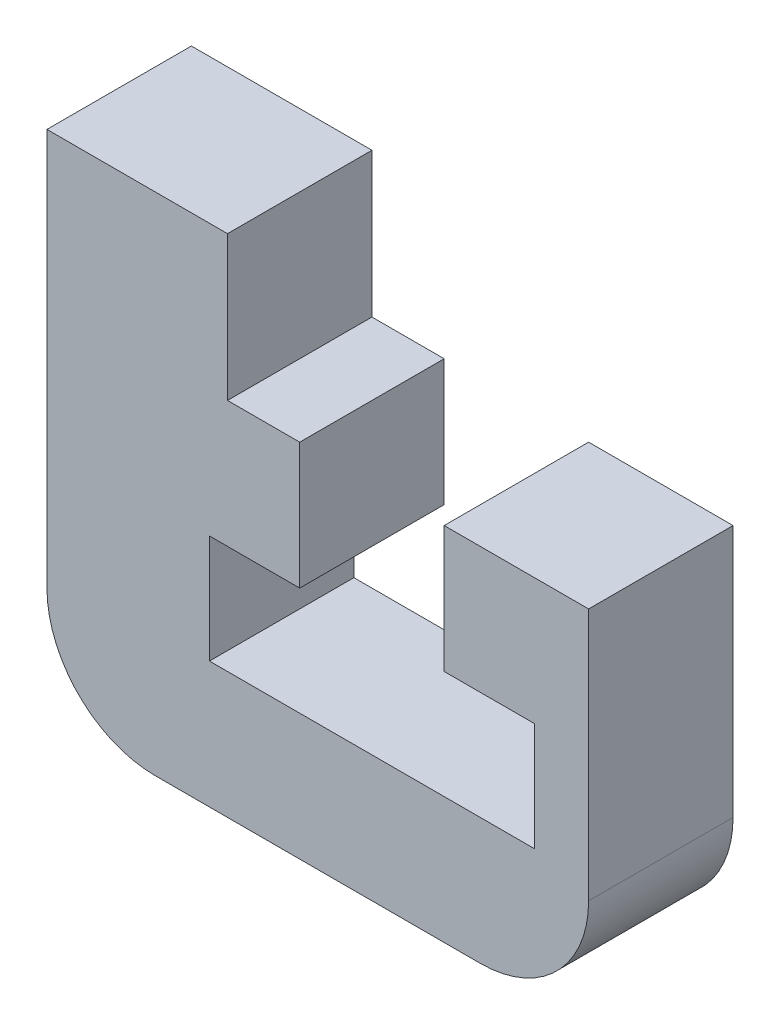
ISO-10303-21;
HEADER;
FILE_DESCRIPTION(('STEP AP214'),'2;1');
FILE_NAME('part.step','',(''),(''),'','','');
FILE_SCHEMA(('AUTOMOTIVE_DESIGN { 1 0 10303 214 1 1 1 1 }'));
ENDSEC;
DATA;
#1=APPLICATION_CONTEXT('core data for automotive mechanical design processes');
#2=APPLICATION_PROTOCOL_DEFINITION('international standard','automotive_design',2000,#1);
#3=PRODUCT_CONTEXT('',#1,'mechanical');
#4=PRODUCT('Part','Part','',(#3));
#5=PRODUCT_RELATED_PRODUCT_CATEGORY('part','',(#4));
#6=PRODUCT_DEFINITION_FORMATION('','',#4);
#7=PRODUCT_DEFINITION_CONTEXT('part definition',#1,'design');
#8=PRODUCT_DEFINITION('design','',#6,#7);
#9=PRODUCT_DEFINITION_SHAPE('','',#8);
#10=(LENGTH_UNIT() NAMED_UNIT(*) SI_UNIT(.MILLI.,.METRE.));
#11=(NAMED_UNIT(*) PLANE_ANGLE_UNIT() SI_UNIT($,.RADIAN.));
#12=(NAMED_UNIT(*) SI_UNIT($,.STERADIAN.) SOLID_ANGLE_UNIT());
#13=UNCERTAINTY_MEASURE_WITH_UNIT(LENGTH_MEASURE(1.E-05),#10,'distance_accuracy_value','');
#14=(GEOMETRIC_REPRESENTATION_CONTEXT(3) GLOBAL_UNCERTAINTY_ASSIGNED_CONTEXT((#13)) GLOBAL_UNIT_ASSIGNED_CONTEXT((#10,
#11,#12)) REPRESENTATION_CONTEXT('',''));
#15=CARTESIAN_POINT('',(0.,0.,0.));
#16=DIRECTION('',(0.,0.,1.));
#17=DIRECTION('',(1.,0.,0.));
#18=AXIS2_PLACEMENT_3D('',#15,#16,#17);
#19=CARTESIAN_POINT('',(-2.,12.0010272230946,4.));
#20=DIRECTION('',(0.,0.,-1.));
#21=DIRECTION('',(-1.,0.,0.));
#22=AXIS2_PLACEMENT_3D('',#19,#20,#21);
#23=CYLINDRICAL_SURFACE('',#22,3.);
#24=CARTESIAN_POINT('',(-2.,12.0010272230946,0.));
#25=DIRECTION('',(0.,0.,1.));
#26=DIRECTION('',(1.,0.,0.));
#27=AXIS2_PLACEMENT_3D('',#24,#25,#26);
#28=CIRCLE('',#27,3.);
#29=CARTESIAN_POINT('',(-5.,12.0010272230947,0.));
#30=VERTEX_POINT('',#29);
#31=CARTESIAN_POINT('',(-1.99999999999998,9.00102722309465,0.));
#32=VERTEX_POINT('',#31);
#33=EDGE_CURVE('E179',#30,#32,#28,.T.);
#34=ORIENTED_EDGE('',*,*,#33,.T.);
#35=DIRECTION('',(0.,0.,-1.));
#36=VECTOR('',#35,1.);
#37=CARTESIAN_POINT('',(-1.99999999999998,9.00102722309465,4.));
#38=LINE('',#37,#36);
#39=CARTESIAN_POINT('',(-1.99999999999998,9.00102722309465,4.));
#40=VERTEX_POINT('',#39);
#41=EDGE_CURVE('E11',#40,#32,#38,.T.);
#42=ORIENTED_EDGE('',*,*,#41,.F.);
#43=CARTESIAN_POINT('',(-2.,12.0010272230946,4.));
#44=DIRECTION('',(0.,0.,1.));
#45=DIRECTION('',(1.,0.,0.));
#46=AXIS2_PLACEMENT_3D('',#43,#44,#45);
#47=CIRCLE('',#46,3.);
#48=CARTESIAN_POINT('',(-5.,12.0010272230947,4.));
#49=VERTEX_POINT('',#48);
#50=EDGE_CURVE('E209',#49,#40,#47,.T.);
#51=ORIENTED_EDGE('',*,*,#50,.F.);
#52=DIRECTION('',(0.,0.,-1.));
#53=VECTOR('',#52,1.);
#54=CARTESIAN_POINT('',(-5.,12.0010272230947,4.));
#55=LINE('',#54,#53);
#56=EDGE_CURVE('E175',#49,#30,#55,.T.);
#57=ORIENTED_EDGE('',*,*,#56,.T.);
#58=EDGE_LOOP('',(#34,#42,#51,#57));
#59=FACE_BOUND('',#58,.T.);
#60=ADVANCED_FACE('F35',(#59),#23,.T.);
#61=CARTESIAN_POINT('',(6.99999999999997,9.00102722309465,4.));
#62=DIRECTION('',(0.,1.,0.));
#63=DIRECTION('',(0.,0.,1.));
#64=AXIS2_PLACEMENT_3D('',#61,#62,#63);
#65=PLANE('',#64);
#66=DIRECTION('',(1.,0.,0.));
#67=VECTOR('',#66,1.);
#68=CARTESIAN_POINT('',(6.99999999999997,9.00102722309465,0.));
#69=LINE('',#68,#67);
#70=CARTESIAN_POINT('',(6.99999999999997,9.00102722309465,0.));
#71=VERTEX_POINT('',#70);
#72=EDGE_CURVE('E182',#32,#71,#69,.T.);
#73=ORIENTED_EDGE('',*,*,#72,.T.);
#74=DIRECTION('',(0.,0.,-1.));
#75=VECTOR('',#74,1.);
#76=CARTESIAN_POINT('',(6.99999999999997,9.00102722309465,4.));
#77=LINE('',#76,#75);
#78=CARTESIAN_POINT('',(6.99999999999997,9.00102722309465,4.));
#79=VERTEX_POINT('',#78);
#80=EDGE_CURVE('E43',#79,#71,#77,.T.);
#81=ORIENTED_EDGE('',*,*,#80,.F.);
#82=DIRECTION('',(1.,0.,0.));
#83=VECTOR('',#82,1.);
#84=CARTESIAN_POINT('',(6.99999999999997,9.00102722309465,4.));
#85=LINE('',#84,#83);
#86=EDGE_CURVE('E118',#40,#79,#85,.T.);
#87=ORIENTED_EDGE('',*,*,#86,.F.);
#88=ORIENTED_EDGE('',*,*,#41,.T.);
#89=EDGE_LOOP('',(#73,#81,#87,#88));
#90=FACE_BOUND('',#89,.T.);
#91=ADVANCED_FACE('F307',(#90),#65,.F.);
#92=CARTESIAN_POINT('',(6.99999999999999,12.0010272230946,4.));
#93=DIRECTION('',(0.,0.,-1.));
#94=DIRECTION('',(-1.,0.,0.));
#95=AXIS2_PLACEMENT_3D('',#92,#93,#94);
#96=CYLINDRICAL_SURFACE('',#95,3.);
#97=CARTESIAN_POINT('',(6.99999999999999,12.0010272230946,0.));
#98=DIRECTION('',(0.,0.,1.));
#99=DIRECTION('',(-1.,0.,0.));
#100=AXIS2_PLACEMENT_3D('',#97,#98,#99);
#101=CIRCLE('',#100,3.);
#102=CARTESIAN_POINT('',(9.99999999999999,12.0010272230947,0.));
#103=VERTEX_POINT('',#102);
#104=EDGE_CURVE('E184',#71,#103,#101,.T.);
#105=ORIENTED_EDGE('',*,*,#104,.T.);
#106=DIRECTION('',(0.,0.,-1.));
#107=VECTOR('',#106,1.);
#108=CARTESIAN_POINT('',(9.99999999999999,12.0010272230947,4.));
#109=LINE('',#108,#107);
#110=CARTESIAN_POINT('',(9.99999999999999,12.0010272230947,4.));
#111=VERTEX_POINT('',#110);
#112=EDGE_CURVE('E240',#111,#103,#109,.T.);
#113=ORIENTED_EDGE('',*,*,#112,.F.);
#114=CARTESIAN_POINT('',(6.99999999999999,12.0010272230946,4.));
#115=DIRECTION('',(0.,0.,1.));
#116=DIRECTION('',(-1.,0.,0.));
#117=AXIS2_PLACEMENT_3D('',#114,#115,#116);
#118=CIRCLE('',#117,3.);
#119=EDGE_CURVE('E248',#79,#111,#118,.T.);
#120=ORIENTED_EDGE('',*,*,#119,.F.);
#121=ORIENTED_EDGE('',*,*,#80,.T.);
#122=EDGE_LOOP('',(#105,#113,#120,#121));
#123=FACE_BOUND('',#122,.T.);
#124=ADVANCED_FACE('F246',(#123),#96,.T.);
#125=CARTESIAN_POINT('',(9.99999999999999,19.0010272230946,4.));
#126=DIRECTION('',(-1.,0.,0.));
#127=DIRECTION('',(0.,0.,1.));
#128=AXIS2_PLACEMENT_3D('',#125,#126,#127);
#129=PLANE('',#128);
#130=DIRECTION('',(0.,1.,0.));
#131=VECTOR('',#130,1.);
#132=CARTESIAN_POINT('',(9.99999999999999,19.0010272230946,0.));
#133=LINE('',#132,#131);
#134=CARTESIAN_POINT('',(9.99999999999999,19.0010272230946,0.));
#135=VERTEX_POINT('',#134);
#136=EDGE_CURVE('E186',#103,#135,#133,.T.);
#137=ORIENTED_EDGE('',*,*,#136,.T.);
#138=DIRECTION('',(0.,0.,-1.));
#139=VECTOR('',#138,1.);
#140=CARTESIAN_POINT('',(9.99999999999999,19.0010272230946,4.));
#141=LINE('',#140,#139);
#142=CARTESIAN_POINT('',(9.99999999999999,19.0010272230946,4.));
#143=VERTEX_POINT('',#142);
#144=EDGE_CURVE('E237',#143,#135,#141,.T.);
#145=ORIENTED_EDGE('',*,*,#144,.F.);
#146=DIRECTION('',(0.,1.,0.));
#147=VECTOR('',#146,1.);
#148=CARTESIAN_POINT('',(9.99999999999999,19.0010272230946,4.));
#149=LINE('',#148,#147);
#150=EDGE_CURVE('E266',#111,#143,#149,.T.);
#151=ORIENTED_EDGE('',*,*,#150,.F.);
#152=ORIENTED_EDGE('',*,*,#112,.T.);
#153=EDGE_LOOP('',(#137,#145,#151,#152));
#154=FACE_BOUND('',#153,.T.);
#155=ADVANCED_FACE('F257',(#154),#129,.F.);
#156=CARTESIAN_POINT('',(6.,19.0010272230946,4.));
#157=DIRECTION('',(0.,-1.,0.));
#158=DIRECTION('',(0.,0.,-1.));
#159=AXIS2_PLACEMENT_3D('',#156,#157,#158);
#160=PLANE('',#159);
#161=DIRECTION('',(-1.,0.,0.));
#162=VECTOR('',#161,1.);
#163=CARTESIAN_POINT('',(6.,19.0010272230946,0.));
#164=LINE('',#163,#162);
#165=CARTESIAN_POINT('',(6.,19.0010272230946,0.));
#166=VERTEX_POINT('',#165);
#167=EDGE_CURVE('E188',#135,#166,#164,.T.);
#168=ORIENTED_EDGE('',*,*,#167,.T.);
#169=DIRECTION('',(0.,0.,-1.));
#170=VECTOR('',#169,1.);
#171=CARTESIAN_POINT('',(6.,19.0010272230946,4.));
#172=LINE('',#171,#170);
#173=CARTESIAN_POINT('',(6.,19.0010272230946,4.));
#174=VERTEX_POINT('',#173);
#175=EDGE_CURVE('E234',#174,#166,#172,.T.);
#176=ORIENTED_EDGE('',*,*,#175,.F.);
#177=DIRECTION('',(-1.,0.,0.));
#178=VECTOR('',#177,1.);
#179=CARTESIAN_POINT('',(6.,19.0010272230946,4.));
#180=LINE('',#179,#178);
#181=EDGE_CURVE('E263',#143,#174,#180,.T.);
#182=ORIENTED_EDGE('',*,*,#181,.F.);
#183=ORIENTED_EDGE('',*,*,#144,.T.);
#184=EDGE_LOOP('',(#168,#176,#182,#183));
#185=FACE_BOUND('',#184,.T.);
#186=ADVANCED_FACE('F261',(#185),#160,.F.);
#187=CARTESIAN_POINT('',(6.,19.0010272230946,4.));
#188=DIRECTION('',(1.,0.,0.));
#189=DIRECTION('',(0.,0.,-1.));
#190=AXIS2_PLACEMENT_3D('',#187,#188,#189);
#191=PLANE('',#190);
#192=DIRECTION('',(0.,-1.,0.));
#193=VECTOR('',#192,1.);
#194=CARTESIAN_POINT('',(6.,19.0010272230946,0.));
#195=LINE('',#194,#193);
#196=CARTESIAN_POINT('',(6.,15.5010272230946,0.));
#197=VERTEX_POINT('',#196);
#198=EDGE_CURVE('E190',#166,#197,#195,.T.);
#199=ORIENTED_EDGE('',*,*,#198,.T.);
#200=DIRECTION('',(0.,0.,-1.));
#201=VECTOR('',#200,1.);
#202=CARTESIAN_POINT('',(6.,15.5010272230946,4.));
#203=LINE('',#202,#201);
#204=CARTESIAN_POINT('',(6.,15.5010272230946,4.));
#205=VERTEX_POINT('',#204);
#206=EDGE_CURVE('E231',#205,#197,#203,.T.);
#207=ORIENTED_EDGE('',*,*,#206,.F.);
#208=DIRECTION('',(0.,-1.,0.));
#209=VECTOR('',#208,1.);
#210=CARTESIAN_POINT('',(6.,19.0010272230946,4.));
#211=LINE('',#210,#209);
#212=EDGE_CURVE('E265',#174,#205,#211,.T.);
#213=ORIENTED_EDGE('',*,*,#212,.F.);
#214=ORIENTED_EDGE('',*,*,#175,.T.);
#215=EDGE_LOOP('',(#199,#207,#213,#214));
#216=FACE_BOUND('',#215,.T.);
#217=ADVANCED_FACE('F320',(#216),#191,.F.);
#218=CARTESIAN_POINT('',(6.,15.5010272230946,4.));
#219=DIRECTION('',(0.,1.,0.));
#220=DIRECTION('',(0.,0.,1.));
#221=AXIS2_PLACEMENT_3D('',#218,#219,#220);
#222=PLANE('',#221);
#223=DIRECTION('',(1.,0.,0.));
#224=VECTOR('',#223,1.);
#225=CARTESIAN_POINT('',(6.,15.5010272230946,0.));
#226=LINE('',#225,#224);
#227=CARTESIAN_POINT('',(8.5,15.5010272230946,0.));
#228=VERTEX_POINT('',#227);
#229=EDGE_CURVE('E192',#197,#228,#226,.T.);
#230=ORIENTED_EDGE('',*,*,#229,.T.);
#231=DIRECTION('',(0.,0.,-1.));
#232=VECTOR('',#231,1.);
#233=CARTESIAN_POINT('',(8.5,15.5010272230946,4.));
#234=LINE('',#233,#232);
#235=CARTESIAN_POINT('',(8.5,15.5010272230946,4.));
#236=VERTEX_POINT('',#235);
#237=EDGE_CURVE('E228',#236,#228,#234,.T.);
#238=ORIENTED_EDGE('',*,*,#237,.F.);
#239=DIRECTION('',(1.,0.,0.));
#240=VECTOR('',#239,1.);
#241=CARTESIAN_POINT('',(6.,15.5010272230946,4.));
#242=LINE('',#241,#240);
#243=EDGE_CURVE('E268',#205,#236,#242,.T.);
#244=ORIENTED_EDGE('',*,*,#243,.F.);
#245=ORIENTED_EDGE('',*,*,#206,.T.);
#246=EDGE_LOOP('',(#230,#238,#244,#245));
#247=FACE_BOUND('',#246,.T.);
#248=ADVANCED_FACE('F323',(#247),#222,.F.);
#249=CARTESIAN_POINT('',(8.5,15.5010272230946,4.));
#250=DIRECTION('',(1.,0.,0.));
#251=DIRECTION('',(0.,0.,-1.));
#252=AXIS2_PLACEMENT_3D('',#249,#250,#251);
#253=PLANE('',#252);
#254=DIRECTION('',(0.,-1.,0.));
#255=VECTOR('',#254,1.);
#256=CARTESIAN_POINT('',(8.5,15.5010272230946,0.));
#257=LINE('',#256,#255);
#258=CARTESIAN_POINT('',(8.5,12.5010272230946,0.));
#259=VERTEX_POINT('',#258);
#260=EDGE_CURVE('E194',#228,#259,#257,.T.);
#261=ORIENTED_EDGE('',*,*,#260,.T.);
#262=DIRECTION('',(0.,0.,-1.));
#263=VECTOR('',#262,1.);
#264=CARTESIAN_POINT('',(8.5,12.5010272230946,4.));
#265=LINE('',#264,#263);
#266=CARTESIAN_POINT('',(8.5,12.5010272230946,4.));
#267=VERTEX_POINT('',#266);
#268=EDGE_CURVE('E225',#267,#259,#265,.T.);
#269=ORIENTED_EDGE('',*,*,#268,.F.);
#270=DIRECTION('',(0.,-1.,0.));
#271=VECTOR('',#270,1.);
#272=CARTESIAN_POINT('',(8.5,15.5010272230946,4.));
#273=LINE('',#272,#271);
#274=EDGE_CURVE('E274',#236,#267,#273,.T.);
#275=ORIENTED_EDGE('',*,*,#274,.F.);
#276=ORIENTED_EDGE('',*,*,#237,.T.);
#277=EDGE_LOOP('',(#261,#269,#275,#276));
#278=FACE_BOUND('',#277,.T.);
#279=ADVANCED_FACE('F327',(#278),#253,.F.);
#280=CARTESIAN_POINT('',(8.5,12.5010272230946,4.));
#281=DIRECTION('',(0.,-1.,0.));
#282=DIRECTION('',(1.,0.,0.));
#283=AXIS2_PLACEMENT_3D('',#280,#281,#282);
#284=PLANE('',#283);
#285=DIRECTION('',(-1.,0.,0.));
#286=VECTOR('',#285,1.);
#287=CARTESIAN_POINT('',(8.5,12.5010272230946,0.));
#288=LINE('',#287,#286);
#289=CARTESIAN_POINT('',(-0.5,12.5010272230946,0.));
#290=VERTEX_POINT('',#289);
#291=EDGE_CURVE('E196',#259,#290,#288,.T.);
#292=ORIENTED_EDGE('',*,*,#291,.T.);
#293=DIRECTION('',(0.,0.,-1.));
#294=VECTOR('',#293,1.);
#295=CARTESIAN_POINT('',(-0.5,12.5010272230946,4.));
#296=LINE('',#295,#294);
#297=CARTESIAN_POINT('',(-0.5,12.5010272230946,4.));
#298=VERTEX_POINT('',#297);
#299=EDGE_CURVE('E222',#298,#290,#296,.T.);
#300=ORIENTED_EDGE('',*,*,#299,.F.);
#301=DIRECTION('',(-1.,0.,0.));
#302=VECTOR('',#301,1.);
#303=CARTESIAN_POINT('',(8.5,12.5010272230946,4.));
#304=LINE('',#303,#302);
#305=EDGE_CURVE('E276',#267,#298,#304,.T.);
#306=ORIENTED_EDGE('',*,*,#305,.F.);
#307=ORIENTED_EDGE('',*,*,#268,.T.);
#308=EDGE_LOOP('',(#292,#300,#306,#307));
#309=FACE_BOUND('',#308,.T.);
#310=ADVANCED_FACE('F331',(#309),#284,.F.);
#311=CARTESIAN_POINT('',(-0.5,12.5010272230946,4.));
#312=DIRECTION('',(-1.,0.,0.));
#313=DIRECTION('',(0.,0.,1.));
#314=AXIS2_PLACEMENT_3D('',#311,#312,#313);
#315=PLANE('',#314);
#316=DIRECTION('',(0.,1.,0.));
#317=VECTOR('',#316,1.);
#318=CARTESIAN_POINT('',(-0.5,12.5010272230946,0.));
#319=LINE('',#318,#317);
#320=CARTESIAN_POINT('',(-0.5,15.5010272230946,0.));
#321=VERTEX_POINT('',#320);
#322=EDGE_CURVE('E198',#290,#321,#319,.T.);
#323=ORIENTED_EDGE('',*,*,#322,.T.);
#324=DIRECTION('',(0.,0.,-1.));
#325=VECTOR('',#324,1.);
#326=CARTESIAN_POINT('',(-0.5,15.5010272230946,4.));
#327=LINE('',#326,#325);
#328=CARTESIAN_POINT('',(-0.5,15.5010272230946,4.));
#329=VERTEX_POINT('',#328);
#330=EDGE_CURVE('E219',#329,#321,#327,.T.);
#331=ORIENTED_EDGE('',*,*,#330,.F.);
#332=DIRECTION('',(0.,1.,0.));
#333=VECTOR('',#332,1.);
#334=CARTESIAN_POINT('',(-0.5,12.5010272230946,4.));
#335=LINE('',#334,#333);
#336=EDGE_CURVE('E278',#298,#329,#335,.T.);
#337=ORIENTED_EDGE('',*,*,#336,.F.);
#338=ORIENTED_EDGE('',*,*,#299,.T.);
#339=EDGE_LOOP('',(#323,#331,#337,#338));
#340=FACE_BOUND('',#339,.T.);
#341=ADVANCED_FACE('F335',(#340),#315,.F.);
#342=CARTESIAN_POINT('',(-0.5,15.5010272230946,4.));
#343=DIRECTION('',(0.,1.,0.));
#344=DIRECTION('',(0.,0.,1.));
#345=AXIS2_PLACEMENT_3D('',#342,#343,#344);
#346=PLANE('',#345);
#347=DIRECTION('',(1.,0.,0.));
#348=VECTOR('',#347,1.);
#349=CARTESIAN_POINT('',(-0.5,15.5010272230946,0.));
#350=LINE('',#349,#348);
#351=CARTESIAN_POINT('',(2.,15.5010272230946,0.));
#352=VERTEX_POINT('',#351);
#353=EDGE_CURVE('E200',#321,#352,#350,.T.);
#354=ORIENTED_EDGE('',*,*,#353,.T.);
#355=DIRECTION('',(0.,0.,-1.));
#356=VECTOR('',#355,1.);
#357=CARTESIAN_POINT('',(2.,15.5010272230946,4.));
#358=LINE('',#357,#356);
#359=CARTESIAN_POINT('',(2.,15.5010272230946,4.));
#360=VERTEX_POINT('',#359);
#361=EDGE_CURVE('E216',#360,#352,#358,.T.);
#362=ORIENTED_EDGE('',*,*,#361,.F.);
#363=DIRECTION('',(1.,0.,0.));
#364=VECTOR('',#363,1.);
#365=CARTESIAN_POINT('',(-0.5,15.5010272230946,4.));
#366=LINE('',#365,#364);
#367=EDGE_CURVE('E280',#329,#360,#366,.T.);
#368=ORIENTED_EDGE('',*,*,#367,.F.);
#369=ORIENTED_EDGE('',*,*,#330,.T.);
#370=EDGE_LOOP('',(#354,#362,#368,#369));
#371=FACE_BOUND('',#370,.T.);
#372=ADVANCED_FACE('F339',(#371),#346,.F.);
#373=CARTESIAN_POINT('',(2.,15.5010272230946,4.));
#374=DIRECTION('',(-1.,0.,0.));
#375=DIRECTION('',(0.,0.,1.));
#376=AXIS2_PLACEMENT_3D('',#373,#374,#375);
#377=PLANE('',#376);
#378=DIRECTION('',(0.,1.,0.));
#379=VECTOR('',#378,1.);
#380=CARTESIAN_POINT('',(2.,15.5010272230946,0.));
#381=LINE('',#380,#379);
#382=CARTESIAN_POINT('',(2.,19.0010272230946,0.));
#383=VERTEX_POINT('',#382);
#384=EDGE_CURVE('E202',#352,#383,#381,.T.);
#385=ORIENTED_EDGE('',*,*,#384,.T.);
#386=DIRECTION('',(0.,0.,-1.));
#387=VECTOR('',#386,1.);
#388=CARTESIAN_POINT('',(2.,19.0010272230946,4.));
#389=LINE('',#388,#387);
#390=CARTESIAN_POINT('',(2.,19.0010272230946,4.));
#391=VERTEX_POINT('',#390);
#392=EDGE_CURVE('E213',#391,#383,#389,.T.);
#393=ORIENTED_EDGE('',*,*,#392,.F.);
#394=DIRECTION('',(0.,1.,0.));
#395=VECTOR('',#394,1.);
#396=CARTESIAN_POINT('',(2.,15.5010272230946,4.));
#397=LINE('',#396,#395);
#398=EDGE_CURVE('E282',#360,#391,#397,.T.);
#399=ORIENTED_EDGE('',*,*,#398,.F.);
#400=ORIENTED_EDGE('',*,*,#361,.T.);
#401=EDGE_LOOP('',(#385,#393,#399,#400));
#402=FACE_BOUND('',#401,.T.);
#403=ADVANCED_FACE('F288',(#402),#377,.F.);
#404=CARTESIAN_POINT('',(2.,19.0010272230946,4.));
#405=DIRECTION('',(0.,-1.,0.));
#406=DIRECTION('',(0.,0.,-1.));
#407=AXIS2_PLACEMENT_3D('',#404,#405,#406);
#408=PLANE('',#407);
#409=DIRECTION('',(-1.,0.,0.));
#410=VECTOR('',#409,1.);
#411=CARTESIAN_POINT('',(2.,19.0010272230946,0.));
#412=LINE('',#411,#410);
#413=CARTESIAN_POINT('',(0.,19.0010272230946,0.));
#414=VERTEX_POINT('',#413);
#415=EDGE_CURVE('E204',#383,#414,#412,.T.);
#416=ORIENTED_EDGE('',*,*,#415,.T.);
#417=DIRECTION('',(0.,0.,-1.));
#418=VECTOR('',#417,1.);
#419=CARTESIAN_POINT('',(0.,19.0010272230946,4.));
#420=LINE('',#419,#418);
#421=CARTESIAN_POINT('',(0.,19.0010272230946,4.));
#422=VERTEX_POINT('',#421);
#423=EDGE_CURVE('E170',#422,#414,#420,.T.);
#424=ORIENTED_EDGE('',*,*,#423,.F.);
#425=DIRECTION('',(-1.,0.,0.));
#426=VECTOR('',#425,1.);
#427=CARTESIAN_POINT('',(2.,19.0010272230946,4.));
#428=LINE('',#427,#426);
#429=EDGE_CURVE('E161',#391,#422,#428,.T.);
#430=ORIENTED_EDGE('',*,*,#429,.F.);
#431=ORIENTED_EDGE('',*,*,#392,.T.);
#432=EDGE_LOOP('',(#416,#424,#430,#431));
#433=FACE_BOUND('',#432,.T.);
#434=ADVANCED_FACE('F292',(#433),#408,.F.);
#435=CARTESIAN_POINT('',(0.,19.0010272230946,4.));
#436=DIRECTION('',(-1.,0.,0.));
#437=DIRECTION('',(0.,0.,1.));
#438=AXIS2_PLACEMENT_3D('',#435,#436,#437);
#439=PLANE('',#438);
#440=DIRECTION('',(0.,1.,0.));
#441=VECTOR('',#440,1.);
#442=CARTESIAN_POINT('',(0.,19.0010272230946,0.));
#443=LINE('',#442,#441);
#444=CARTESIAN_POINT('',(0.,23.0010272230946,0.));
#445=VERTEX_POINT('',#444);
#446=EDGE_CURVE('E169',#414,#445,#443,.T.);
#447=ORIENTED_EDGE('',*,*,#446,.T.);
#448=DIRECTION('',(0.,0.,-1.));
#449=VECTOR('',#448,1.);
#450=CARTESIAN_POINT('',(0.,23.0010272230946,4.));
#451=LINE('',#450,#449);
#452=CARTESIAN_POINT('',(0.,23.0010272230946,4.));
#453=VERTEX_POINT('',#452);
#454=EDGE_CURVE('E166',#453,#445,#451,.T.);
#455=ORIENTED_EDGE('',*,*,#454,.F.);
#456=DIRECTION('',(0.,1.,0.));
#457=VECTOR('',#456,1.);
#458=CARTESIAN_POINT('',(0.,19.0010272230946,4.));
#459=LINE('',#458,#457);
#460=EDGE_CURVE('E155',#422,#453,#459,.T.);
#461=ORIENTED_EDGE('',*,*,#460,.F.);
#462=ORIENTED_EDGE('',*,*,#423,.T.);
#463=EDGE_LOOP('',(#447,#455,#461,#462));
#464=FACE_BOUND('',#463,.T.);
#465=ADVANCED_FACE('F167',(#464),#439,.F.);
#466=CARTESIAN_POINT('',(0.,23.0010272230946,4.));
#467=DIRECTION('',(0.,-1.,0.));
#468=DIRECTION('',(0.,0.,-1.));
#469=AXIS2_PLACEMENT_3D('',#466,#467,#468);
#470=PLANE('',#469);
#471=DIRECTION('',(-1.,0.,0.));
#472=VECTOR('',#471,1.);
#473=CARTESIAN_POINT('',(0.,23.0010272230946,0.));
#474=LINE('',#473,#472);
#475=CARTESIAN_POINT('',(-5.,23.0010272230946,0.));
#476=VERTEX_POINT('',#475);
#477=EDGE_CURVE('E104',#445,#476,#474,.T.);
#478=ORIENTED_EDGE('',*,*,#477,.T.);
#479=DIRECTION('',(0.,0.,-1.));
#480=VECTOR('',#479,1.);
#481=CARTESIAN_POINT('',(-5.,23.0010272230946,4.));
#482=LINE('',#481,#480);
#483=CARTESIAN_POINT('',(-5.,23.0010272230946,4.));
#484=VERTEX_POINT('',#483);
#485=EDGE_CURVE('E171',#484,#476,#482,.T.);
#486=ORIENTED_EDGE('',*,*,#485,.F.);
#487=DIRECTION('',(-1.,0.,0.));
#488=VECTOR('',#487,1.);
#489=CARTESIAN_POINT('',(0.,23.0010272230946,4.));
#490=LINE('',#489,#488);
#491=EDGE_CURVE('E159',#453,#484,#490,.T.);
#492=ORIENTED_EDGE('',*,*,#491,.F.);
#493=ORIENTED_EDGE('',*,*,#454,.T.);
#494=EDGE_LOOP('',(#478,#486,#492,#493));
#495=FACE_BOUND('',#494,.T.);
#496=ADVANCED_FACE('F173',(#495),#470,.F.);
#497=CARTESIAN_POINT('',(-5.,23.0010272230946,4.));
#498=DIRECTION('',(1.,0.,0.));
#499=DIRECTION('',(0.,1.,0.));
#500=AXIS2_PLACEMENT_3D('',#497,#498,#499);
#501=PLANE('',#500);
#502=DIRECTION('',(0.,-1.,0.));
#503=VECTOR('',#502,1.);
#504=CARTESIAN_POINT('',(-5.,23.0010272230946,0.));
#505=LINE('',#504,#503);
#506=EDGE_CURVE('E110',#476,#30,#505,.T.);
#507=ORIENTED_EDGE('',*,*,#506,.T.);
#508=ORIENTED_EDGE('',*,*,#56,.F.);
#509=DIRECTION('',(0.,-1.,0.));
#510=VECTOR('',#509,1.);
#511=CARTESIAN_POINT('',(-5.,23.0010272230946,4.));
#512=LINE('',#511,#510);
#513=EDGE_CURVE('E51',#484,#49,#512,.T.);
#514=ORIENTED_EDGE('',*,*,#513,.F.);
#515=ORIENTED_EDGE('',*,*,#485,.T.);
#516=EDGE_LOOP('',(#507,#508,#514,#515));
#517=FACE_BOUND('',#516,.T.);
#518=ADVANCED_FACE('F296',(#517),#501,.F.);
#519=CARTESIAN_POINT('',(-2.,12.0010272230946,4.));
#520=DIRECTION('',(0.,0.,1.));
#521=DIRECTION('',(1.,0.,0.));
#522=AXIS2_PLACEMENT_3D('',#519,#520,#521);
#523=PLANE('',#522);
#524=ORIENTED_EDGE('',*,*,#50,.T.);
#525=ORIENTED_EDGE('',*,*,#86,.T.);
#526=ORIENTED_EDGE('',*,*,#119,.T.);
#527=ORIENTED_EDGE('',*,*,#150,.T.);
#528=ORIENTED_EDGE('',*,*,#181,.T.);
#529=ORIENTED_EDGE('',*,*,#212,.T.);
#530=ORIENTED_EDGE('',*,*,#243,.T.);
#531=ORIENTED_EDGE('',*,*,#274,.T.);
#532=ORIENTED_EDGE('',*,*,#305,.T.);
#533=ORIENTED_EDGE('',*,*,#336,.T.);
#534=ORIENTED_EDGE('',*,*,#367,.T.);
#535=ORIENTED_EDGE('',*,*,#398,.T.);
#536=ORIENTED_EDGE('',*,*,#429,.T.);
#537=ORIENTED_EDGE('',*,*,#460,.T.);
#538=ORIENTED_EDGE('',*,*,#491,.T.);
#539=ORIENTED_EDGE('',*,*,#513,.T.);
#540=EDGE_LOOP('',(#524,#525,#526,#527,#528,#529,#530,#531,#532,#533,#534,#535,#536,#537,#538,#539));
#541=FACE_BOUND('',#540,.T.);
#542=ADVANCED_FACE('F157',(#541),#523,.T.);
#543=CARTESIAN_POINT('',(-2.,12.0010272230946,0.));
#544=DIRECTION('',(0.,0.,1.));
#545=DIRECTION('',(1.,0.,0.));
#546=AXIS2_PLACEMENT_3D('',#543,#544,#545);
#547=PLANE('',#546);
#548=ORIENTED_EDGE('',*,*,#33,.F.);
#549=ORIENTED_EDGE('',*,*,#506,.F.);
#550=ORIENTED_EDGE('',*,*,#477,.F.);
#551=ORIENTED_EDGE('',*,*,#446,.F.);
#552=ORIENTED_EDGE('',*,*,#415,.F.);
#553=ORIENTED_EDGE('',*,*,#384,.F.);
#554=ORIENTED_EDGE('',*,*,#353,.F.);
#555=ORIENTED_EDGE('',*,*,#322,.F.);
#556=ORIENTED_EDGE('',*,*,#291,.F.);
#557=ORIENTED_EDGE('',*,*,#260,.F.);
#558=ORIENTED_EDGE('',*,*,#229,.F.);
#559=ORIENTED_EDGE('',*,*,#198,.F.);
#560=ORIENTED_EDGE('',*,*,#167,.F.);
#561=ORIENTED_EDGE('',*,*,#136,.F.);
#562=ORIENTED_EDGE('',*,*,#104,.F.);
#563=ORIENTED_EDGE('',*,*,#72,.F.);
#564=EDGE_LOOP('',(#548,#549,#550,#551,#552,#553,#554,#555,#556,#557,#558,#559,#560,#561,#562,#563));
#565=FACE_BOUND('',#564,.T.);
#566=ADVANCED_FACE('F252',(#565),#547,.F.);
#567=CLOSED_SHELL('',(#60,#91,#124,#155,#186,#217,#248,#279,#310,#341,#372,#403,#434,#465,#496,
#518,#542,#566));
#568=MANIFOLD_SOLID_BREP('B2',#567);
#569=ADVANCED_BREP_SHAPE_REPRESENTATION('',(#18,#568),#14);
#570=SHAPE_DEFINITION_REPRESENTATION(#9,#569);
ENDSEC;
END-ISO-10303-21;
